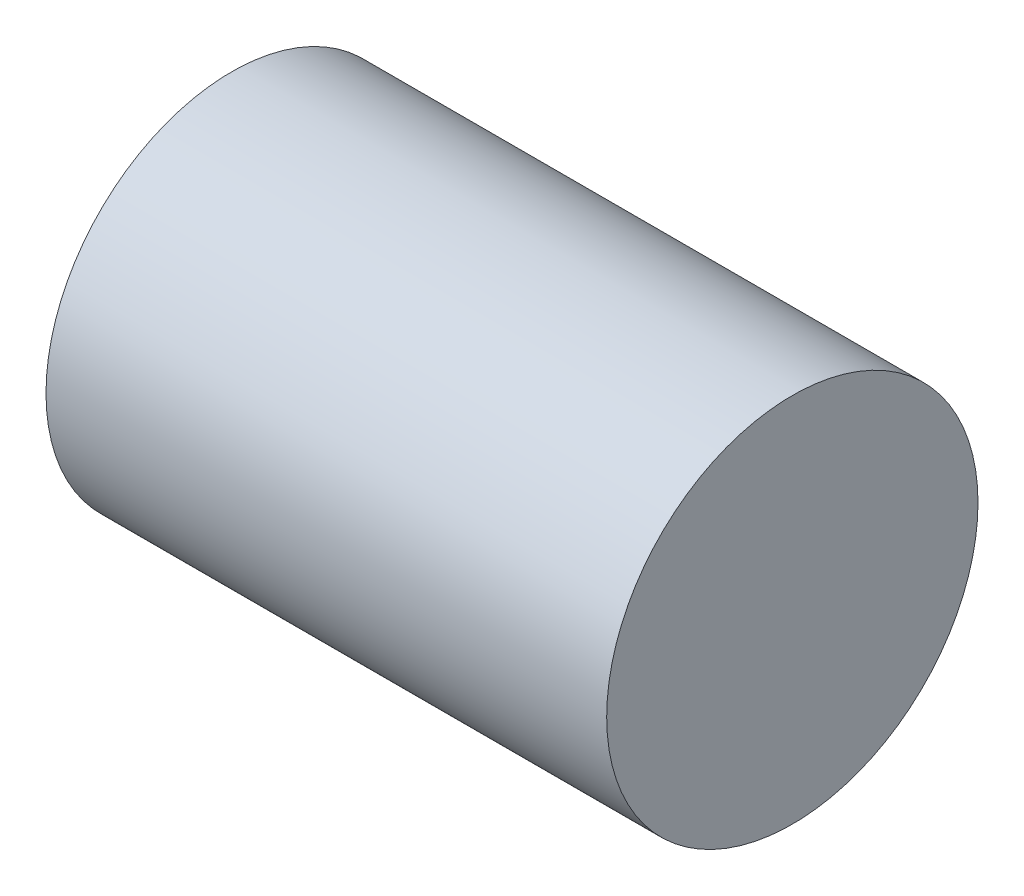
ISO-10303-21;
HEADER;
FILE_DESCRIPTION(('STEP AP214'),'2;1');
FILE_NAME('part.step','',(''),(''),'','','');
FILE_SCHEMA(('AUTOMOTIVE_DESIGN { 1 0 10303 214 1 1 1 1 }'));
ENDSEC;
DATA;
#1=APPLICATION_CONTEXT('core data for automotive mechanical design processes');
#2=APPLICATION_PROTOCOL_DEFINITION('international standard','automotive_design',2000,#1);
#3=PRODUCT_CONTEXT('',#1,'mechanical');
#4=PRODUCT('Part','Part','',(#3));
#5=PRODUCT_RELATED_PRODUCT_CATEGORY('part','',(#4));
#6=PRODUCT_DEFINITION_FORMATION('','',#4);
#7=PRODUCT_DEFINITION_CONTEXT('part definition',#1,'design');
#8=PRODUCT_DEFINITION('design','',#6,#7);
#9=PRODUCT_DEFINITION_SHAPE('','',#8);
#10=(LENGTH_UNIT() NAMED_UNIT(*) SI_UNIT(.MILLI.,.METRE.));
#11=(NAMED_UNIT(*) PLANE_ANGLE_UNIT() SI_UNIT($,.RADIAN.));
#12=(NAMED_UNIT(*) SI_UNIT($,.STERADIAN.) SOLID_ANGLE_UNIT());
#13=UNCERTAINTY_MEASURE_WITH_UNIT(LENGTH_MEASURE(1.E-05),#10,'distance_accuracy_value','');
#14=(GEOMETRIC_REPRESENTATION_CONTEXT(3) GLOBAL_UNCERTAINTY_ASSIGNED_CONTEXT((#13)) GLOBAL_UNIT_ASSIGNED_CONTEXT((#10,
#11,#12)) REPRESENTATION_CONTEXT('',''));
#15=CARTESIAN_POINT('',(0.,0.,0.));
#16=DIRECTION('',(0.,0.,1.));
#17=DIRECTION('',(1.,0.,0.));
#18=AXIS2_PLACEMENT_3D('',#15,#16,#17);
#19=CARTESIAN_POINT('',(0.465136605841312,6.38473913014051,4.50000000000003));
#20=DIRECTION('',(1.,0.,0.));
#21=DIRECTION('',(0.,0.,-1.));
#22=AXIS2_PLACEMENT_3D('',#19,#20,#21);
#23=PLANE('',#22);
#24=CARTESIAN_POINT('',(0.46513660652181,6.38473913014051,4.50000000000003));
#25=DIRECTION('',(-1.,0.,0.));
#26=DIRECTION('',(0.,0.,1.));
#27=AXIS2_PLACEMENT_3D('',#24,#25,#26);
#28=CIRCLE('',#27,0.250000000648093);
#29=CARTESIAN_POINT('',(0.46513660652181,6.38473913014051,4.75000000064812));
#30=VERTEX_POINT('',#29);
#31=EDGE_CURVE('E18',#30,#30,#28,.T.);
#32=ORIENTED_EDGE('',*,*,#31,.T.);
#33=EDGE_LOOP('',(#32));
#34=FACE_BOUND('',#33,.T.);
#35=ADVANCED_FACE('F15',(#34),#23,.F.);
#36=CARTESIAN_POINT('',(0.215136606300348,6.38473913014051,4.50000000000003));
#37=DIRECTION('',(-1.,0.,0.));
#38=DIRECTION('',(0.,0.,1.));
#39=AXIS2_PLACEMENT_3D('',#36,#37,#38);
#40=CONICAL_SURFACE('',#39,0.500000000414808,0.785398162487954);
#41=CARTESIAN_POINT('',(0.215136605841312,6.38473913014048,4.50000000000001));
#42=DIRECTION('',(-1.,0.,0.));
#43=DIRECTION('',(0.,0.,1.));
#44=AXIS2_PLACEMENT_3D('',#41,#42,#43);
#45=CIRCLE('',#44,0.500000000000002);
#46=CARTESIAN_POINT('',(0.215136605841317,6.38473913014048,5.00000000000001));
#47=VERTEX_POINT('',#46);
#48=EDGE_CURVE('E22',#47,#47,#45,.F.);
#49=ORIENTED_EDGE('',*,*,#48,.F.);
#50=EDGE_LOOP('',(#49));
#51=FACE_BOUND('',#50,.T.);
#52=ORIENTED_EDGE('',*,*,#31,.F.);
#53=EDGE_LOOP('',(#52));
#54=FACE_BOUND('',#53,.T.);
#55=ADVANCED_FACE('F35',(#51,#54),#40,.F.);
#56=CARTESIAN_POINT('',(1.72513660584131,1.58473913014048,-2.4));
#57=DIRECTION('',(-1.,0.,0.));
#58=DIRECTION('',(0.,0.,1.));
#59=AXIS2_PLACEMENT_3D('',#56,#57,#58);
#60=PLANE('',#59);
#61=CARTESIAN_POINT('',(1.7251366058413,6.38473913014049,4.49999999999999));
#62=DIRECTION('',(-1.,0.,0.));
#63=DIRECTION('',(0.,0.,1.));
#64=AXIS2_PLACEMENT_3D('',#61,#62,#63);
#65=CIRCLE('',#64,0.500000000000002);
#66=CARTESIAN_POINT('',(1.72513660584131,6.38473913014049,5.));
#67=VERTEX_POINT('',#66);
#68=EDGE_CURVE('E10',#67,#67,#65,.T.);
#69=ORIENTED_EDGE('',*,*,#68,.F.);
#70=EDGE_LOOP('',(#69));
#71=FACE_BOUND('',#70,.T.);
#72=ADVANCED_FACE('F37',(#71),#60,.F.);
#73=CARTESIAN_POINT('',(0.970136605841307,6.38473913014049,4.5));
#74=DIRECTION('',(-1.,0.,0.));
#75=DIRECTION('',(0.,0.,1.));
#76=AXIS2_PLACEMENT_3D('',#73,#74,#75);
#77=CYLINDRICAL_SURFACE('',#76,0.500000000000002);
#78=ORIENTED_EDGE('',*,*,#68,.T.);
#79=EDGE_LOOP('',(#78));
#80=FACE_BOUND('',#79,.T.);
#81=ORIENTED_EDGE('',*,*,#48,.T.);
#82=EDGE_LOOP('',(#81));
#83=FACE_BOUND('',#82,.T.);
#84=ADVANCED_FACE('F44',(#80,#83),#77,.T.);
#85=CLOSED_SHELL('',(#35,#55,#72,#84));
#86=MANIFOLD_SOLID_BREP('B1',#85);
#87=ADVANCED_BREP_SHAPE_REPRESENTATION('',(#18,#86),#14);
#88=SHAPE_DEFINITION_REPRESENTATION(#9,#87);
ENDSEC;
END-ISO-10303-21;
